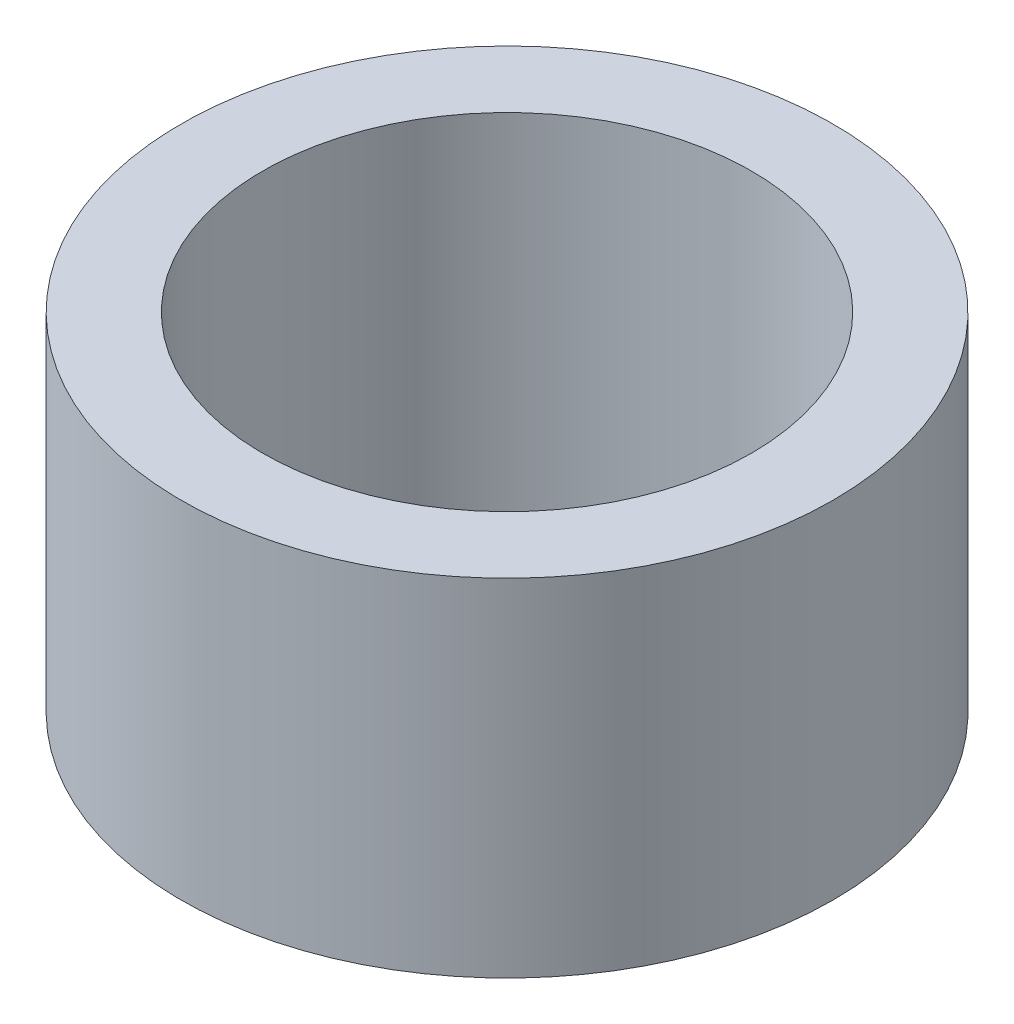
ISO-10303-21;
HEADER;
FILE_DESCRIPTION(('STEP AP214'),'2;1');
FILE_NAME('part.step','',(''),(''),'','','');
FILE_SCHEMA(('AUTOMOTIVE_DESIGN { 1 0 10303 214 1 1 1 1 }'));
ENDSEC;
DATA;
#1=APPLICATION_CONTEXT('core data for automotive mechanical design processes');
#2=APPLICATION_PROTOCOL_DEFINITION('international standard','automotive_design',2000,#1);
#3=PRODUCT_CONTEXT('',#1,'mechanical');
#4=PRODUCT('Part','Part','',(#3));
#5=PRODUCT_RELATED_PRODUCT_CATEGORY('part','',(#4));
#6=PRODUCT_DEFINITION_FORMATION('','',#4);
#7=PRODUCT_DEFINITION_CONTEXT('part definition',#1,'design');
#8=PRODUCT_DEFINITION('design','',#6,#7);
#9=PRODUCT_DEFINITION_SHAPE('','',#8);
#10=(LENGTH_UNIT() NAMED_UNIT(*) SI_UNIT(.MILLI.,.METRE.));
#11=(NAMED_UNIT(*) PLANE_ANGLE_UNIT() SI_UNIT($,.RADIAN.));
#12=(NAMED_UNIT(*) SI_UNIT($,.STERADIAN.) SOLID_ANGLE_UNIT());
#13=UNCERTAINTY_MEASURE_WITH_UNIT(LENGTH_MEASURE(1.E-05),#10,'distance_accuracy_value','');
#14=(GEOMETRIC_REPRESENTATION_CONTEXT(3) GLOBAL_UNCERTAINTY_ASSIGNED_CONTEXT((#13)) GLOBAL_UNIT_ASSIGNED_CONTEXT((#10,
#11,#12)) REPRESENTATION_CONTEXT('',''));
#15=CARTESIAN_POINT('',(0.,0.,0.));
#16=DIRECTION('',(0.,0.,1.));
#17=DIRECTION('',(1.,0.,0.));
#18=AXIS2_PLACEMENT_3D('',#15,#16,#17);
#19=CARTESIAN_POINT('',(0.,4.25000000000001,0.));
#20=DIRECTION('',(0.,-1.,0.));
#21=DIRECTION('',(1.,0.,0.));
#22=AXIS2_PLACEMENT_3D('',#19,#20,#21);
#23=CYLINDRICAL_SURFACE('',#22,4.);
#24=CARTESIAN_POINT('',(0.,4.25000000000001,0.));
#25=DIRECTION('',(0.,-1.,0.));
#26=DIRECTION('',(1.,0.,0.));
#27=AXIS2_PLACEMENT_3D('',#24,#25,#26);
#28=CIRCLE('',#27,4.);
#29=CARTESIAN_POINT('',(4.,4.25,0.));
#30=VERTEX_POINT('',#29);
#31=EDGE_CURVE('E10',#30,#30,#28,.T.);
#32=ORIENTED_EDGE('',*,*,#31,.T.);
#33=EDGE_LOOP('',(#32));
#34=FACE_BOUND('',#33,.T.);
#35=CARTESIAN_POINT('',(0.,0.,0.));
#36=DIRECTION('',(0.,-1.,0.));
#37=DIRECTION('',(1.,0.,0.));
#38=AXIS2_PLACEMENT_3D('',#35,#36,#37);
#39=CIRCLE('',#38,4.);
#40=CARTESIAN_POINT('',(4.,0.,0.));
#41=VERTEX_POINT('',#40);
#42=EDGE_CURVE('E47',#41,#41,#39,.T.);
#43=ORIENTED_EDGE('',*,*,#42,.F.);
#44=EDGE_LOOP('',(#43));
#45=FACE_BOUND('',#44,.T.);
#46=ADVANCED_FACE('F33',(#34,#45),#23,.T.);
#47=CARTESIAN_POINT('',(4.,4.25,0.));
#48=DIRECTION('',(0.,1.,0.));
#49=DIRECTION('',(-1.,0.,0.));
#50=AXIS2_PLACEMENT_3D('',#47,#48,#49);
#51=PLANE('',#50);
#52=CARTESIAN_POINT('',(0.,4.25,0.));
#53=DIRECTION('',(0.,-1.,0.));
#54=DIRECTION('',(1.,0.,0.));
#55=AXIS2_PLACEMENT_3D('',#52,#53,#54);
#56=CIRCLE('',#55,3.);
#57=CARTESIAN_POINT('',(3.,4.25,0.));
#58=VERTEX_POINT('',#57);
#59=EDGE_CURVE('E39',#58,#58,#56,.T.);
#60=ORIENTED_EDGE('',*,*,#59,.T.);
#61=EDGE_LOOP('',(#60));
#62=FACE_BOUND('',#61,.T.);
#63=ORIENTED_EDGE('',*,*,#31,.F.);
#64=EDGE_LOOP('',(#63));
#65=FACE_BOUND('',#64,.T.);
#66=ADVANCED_FACE('F57',(#62,#65),#51,.T.);
#67=CARTESIAN_POINT('',(0.,4.25000000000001,0.));
#68=DIRECTION('',(0.,-1.,0.));
#69=DIRECTION('',(1.,0.,0.));
#70=AXIS2_PLACEMENT_3D('',#67,#68,#69);
#71=CYLINDRICAL_SURFACE('',#70,3.);
#72=CARTESIAN_POINT('',(0.,0.,0.));
#73=DIRECTION('',(0.,-1.,0.));
#74=DIRECTION('',(1.,0.,0.));
#75=AXIS2_PLACEMENT_3D('',#72,#73,#74);
#76=CIRCLE('',#75,3.);
#77=CARTESIAN_POINT('',(3.,0.,0.));
#78=VERTEX_POINT('',#77);
#79=EDGE_CURVE('E43',#78,#78,#76,.T.);
#80=ORIENTED_EDGE('',*,*,#79,.T.);
#81=EDGE_LOOP('',(#80));
#82=FACE_BOUND('',#81,.T.);
#83=ORIENTED_EDGE('',*,*,#59,.F.);
#84=EDGE_LOOP('',(#83));
#85=FACE_BOUND('',#84,.T.);
#86=ADVANCED_FACE('F61',(#82,#85),#71,.F.);
#87=CARTESIAN_POINT('',(3.,0.,0.));
#88=DIRECTION('',(0.,-1.,0.));
#89=DIRECTION('',(1.,0.,0.));
#90=AXIS2_PLACEMENT_3D('',#87,#88,#89);
#91=PLANE('',#90);
#92=ORIENTED_EDGE('',*,*,#42,.T.);
#93=EDGE_LOOP('',(#92));
#94=FACE_BOUND('',#93,.T.);
#95=ORIENTED_EDGE('',*,*,#79,.F.);
#96=EDGE_LOOP('',(#95));
#97=FACE_BOUND('',#96,.T.);
#98=ADVANCED_FACE('F53',(#94,#97),#91,.T.);
#99=CLOSED_SHELL('',(#46,#66,#86,#98));
#100=MANIFOLD_SOLID_BREP('B2',#99);
#101=ADVANCED_BREP_SHAPE_REPRESENTATION('',(#18,#100),#14);
#102=SHAPE_DEFINITION_REPRESENTATION(#9,#101);
ENDSEC;
END-ISO-10303-21;
